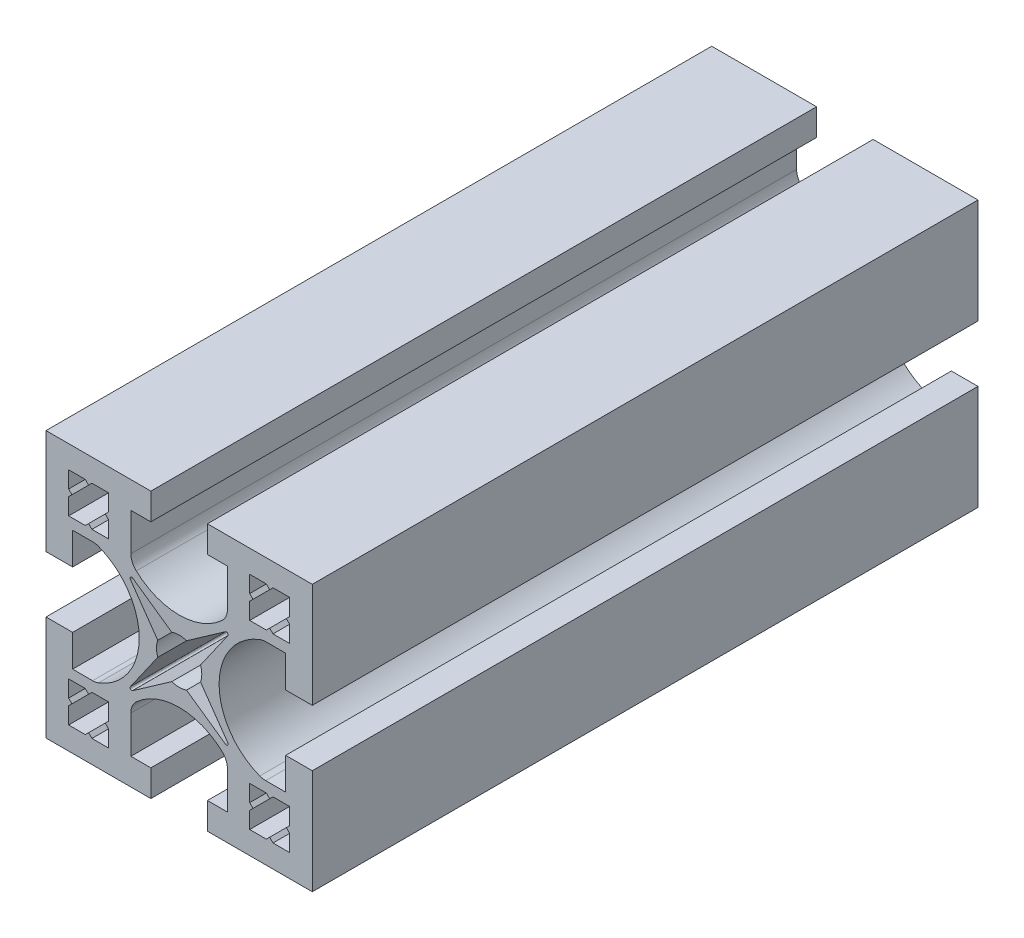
from build123d import *

# Parameters (mm, degrees)
EXTRUDE_1_DEPTH = 50


with BuildPart() as part:
    # Sketch 1 → Extrude 1 (new, symmetric)
    with BuildSketch(Plane.XY):
        with BuildLine():
            Line((-20, 4.25), (-20, 20))
            Line((-20, 20), (-4.25, 20))
            Line((-4.25, 20), (-4.25, 16))
            Line((-4.25, 16), (-7.25, 16))
            Line((-7.25, 16), (-7.25, 10.35825905))
            ThreePointArc((-7.25, 10.35825905), (-7.040313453, 9.356029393), (-6.446428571, 8.521922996))
            ThreePointArc((-6.446428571, 8.521922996), (0, 6), (6.446428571, 8.521922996))
            ThreePointArc((6.446428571, 8.521922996), (7.040313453, 9.356029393), (7.25, 10.35825905))
            Line((7.25, 10.35825905), (7.25, 16))
            Line((7.25, 16), (4.25, 16))
            Line((4.25, 16), (4.25, 20))
            Line((4.25, 20), (20, 20))
            Line((20, 20), (20, 4.25))
            Line((20, 4.25), (16, 4.25))
            Line((16, 4.25), (16, 9.038348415))
            Line((16, 9.038348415), (13, 9.038348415))
            ThreePointArc((13, 9.038348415), (12.546023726, 8.996784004), (12.107142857, 8.873472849))
            ThreePointArc((12.107142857, 8.873472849), (6, 0), (12.107142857, -8.873472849))
            ThreePointArc((12.107142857, -8.873472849), (12.546023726, -8.996784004), (13, -9.038348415))
            Line((13, -9.038348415), (16, -9.038348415))
            Line((16, -9.038348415), (16, -4.25))
            Line((16, -4.25), (20, -4.25))
            Line((20, -4.25), (20, -20))
            Line((20, -20), (4.25, -20))
            Line((4.25, -20), (4.25, -16))
            Line((4.25, -16), (7.25, -16))
            Line((7.25, -16), (7.25, -10.35825905))
            ThreePointArc((7.25, -10.35825905), (7.040313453, -9.356029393), (6.446428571, -8.521922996))
            ThreePointArc((6.446428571, -8.521922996), (0, -6), (-6.446428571, -8.521922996))
            ThreePointArc((-6.446428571, -8.521922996), (-7.040313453, -9.356029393), (-7.25, -10.35825905))
            Line((-7.25, -10.35825905), (-7.25, -16))
            Line((-7.25, -16), (-4.25, -16))
            Line((-4.25, -16), (-4.25, -20))
            Line((-4.25, -20), (-20, -20))
            Line((-20, -20), (-20, -4.25))
            Line((-20, -4.25), (-16, -4.25))
            Line((-16, -4.25), (-16, -9.038348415))
            Line((-16, -9.038348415), (-13, -9.038348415))
            ThreePointArc((-13, -9.038348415), (-12.546023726, -8.996784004), (-12.107142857, -8.873472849))
            ThreePointArc((-12.107142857, -8.873472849), (-6, 0), (-12.107142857, 8.873472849))
            ThreePointArc((-12.107142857, 8.873472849), (-12.546023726, 8.996784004), (-13, 9.038348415))
            Line((-13, 9.038348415), (-16, 9.038348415))
            Line((-16, 9.038348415), (-16, 4.25))
            Line((-16, 4.25), (-20, 4.25))
        make_face()
        Polygon((-16.6, 16.6), (-14.1, 16.6), (-13.6, 16.1), (-13.1, 16.6), (-10.6, 16.6), (-10.6, 14.1), (-11.1, 13.6), (-10.6, 13.1), (-10.6, 10.6), (-13.1, 10.6), (-13.6, 11.1), (-14.1, 10.6), (-16.6, 10.6), (-16.6, 13.1), (-16.1, 13.6), (-16.6, 14.1), align=None, mode=Mode.SUBTRACT)
        with BuildLine():
            Line((-1.108702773, 3.21415279), (-6.97031746, 7.31849958))
            ThreePointArc((-6.97031746, 7.31849958), (-7.290488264, 7.290488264), (-7.31849958, 6.97031746))
            Line((-7.31849958, 6.97031746), (-3.21415279, 1.108702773))
            ThreePointArc((-3.21415279, 1.108702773), (-3.4, 0), (-3.21415279, -1.108702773))
            Line((-3.21415279, -1.108702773), (-7.31849958, -6.97031746))
            ThreePointArc((-7.31849958, -6.97031746), (-7.290488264, -7.290488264), (-6.97031746, -7.31849958))
            Line((-6.97031746, -7.31849958), (-1.108702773, -3.21415279))
            ThreePointArc((-1.108702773, -3.21415279), (0, -3.4), (1.108702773, -3.21415279))
            Line((1.108702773, -3.21415279), (6.97031746, -7.31849958))
            ThreePointArc((6.97031746, -7.31849958), (7.290488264, -7.290488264), (7.31849958, -6.97031746))
            Line((7.31849958, -6.97031746), (3.21415279, -1.108702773))
            ThreePointArc((3.21415279, -1.108702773), (3.4, 0), (3.21415279, 1.108702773))
            Line((3.21415279, 1.108702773), (7.31849958, 6.97031746))
            ThreePointArc((7.31849958, 6.97031746), (7.290488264, 7.290488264), (6.97031746, 7.31849958))
            Line((6.97031746, 7.31849958), (1.108702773, 3.21415279))
            ThreePointArc((1.108702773, 3.21415279), (0, 3.4), (-1.108702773, 3.21415279))
        make_face(mode=Mode.SUBTRACT)
        Polygon((16.6, 14.1), (16.6, 16.6), (14.1, 16.6), (13.6, 16.1), (13.1, 16.6), (10.6, 16.6), (10.6, 14.1), (11.1, 13.6), (10.6, 13.1), (10.6, 10.6), (13.1, 10.6), (13.6, 11.1), (14.1, 10.6), (16.6, 10.6), (16.6, 13.1), (16.1, 13.6), align=None, mode=Mode.SUBTRACT)
        Polygon((16.6, -16.6), (14.1, -16.6), (13.6, -16.1), (13.1, -16.6), (10.6, -16.6), (10.6, -14.1), (11.1, -13.6), (10.6, -13.1), (10.6, -10.6), (13.1, -10.6), (13.6, -11.1), (14.1, -10.6), (16.6, -10.6), (16.6, -13.1), (16.1, -13.6), (16.6, -14.1), align=None, mode=Mode.SUBTRACT)
        Polygon((-16.6, -14.1), (-16.6, -16.6), (-14.1, -16.6), (-13.6, -16.1), (-13.1, -16.6), (-10.6, -16.6), (-10.6, -14.1), (-11.1, -13.6), (-10.6, -13.1), (-10.6, -10.6), (-13.1, -10.6), (-13.6, -11.1), (-14.1, -10.6), (-16.6, -10.6), (-16.6, -13.1), (-16.1, -13.6), align=None, mode=Mode.SUBTRACT)
    extrude(amount=EXTRUDE_1_DEPTH, both=True)


solid = part.part
